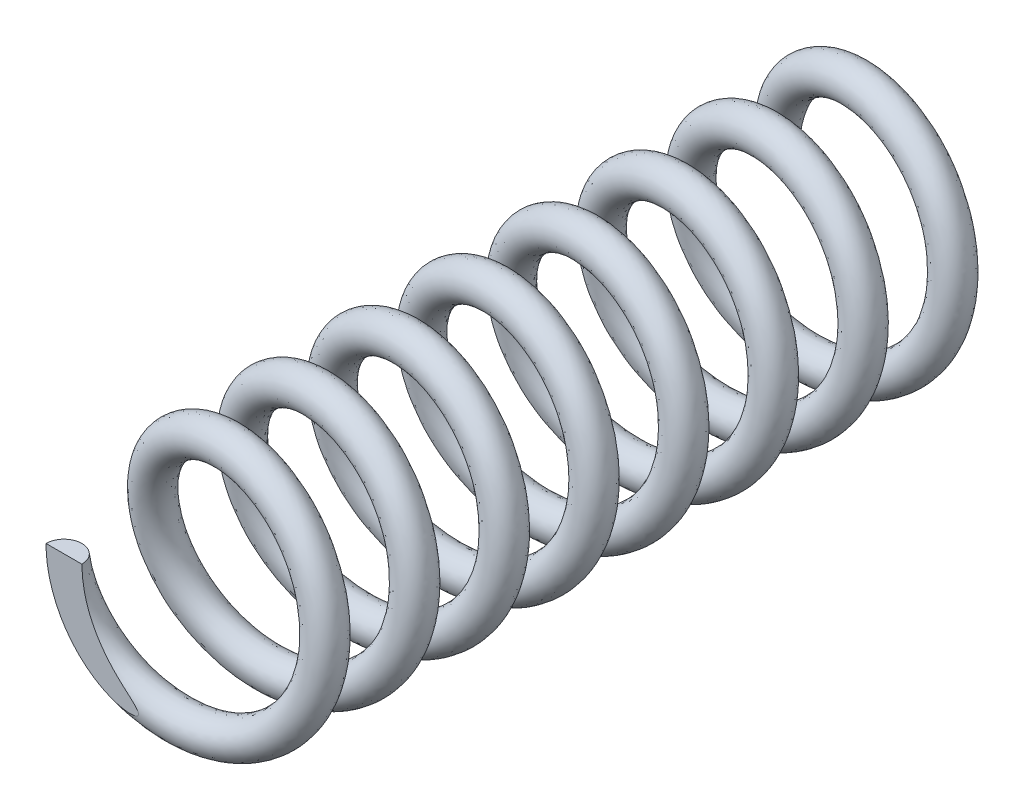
from build123d import *

# Parameters (mm, degrees)
BALAYAGE1_PITCH              = 5
BALAYAGE1_HEIGHT             = 40
BALAYAGE1_RADIUS             = 6
BALAYAGE1_START_ANGLE        = -180
ESQUISSE4_R                  = 1
ENL_V_MAT_EXTRU_1_DEPTH      = 43.17819348
ENL_V_MAT_EXTRU_1_DEPTH_BACK = 43.17819348
ESQUISSE5_W                  = 18.608227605
ESQUISSE5_H                  = 2.668204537
ESQUISSE5_W_2                = 24.602580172
ESQUISSE5_H_2                = 3.5


with BuildPart() as part:
    # Balayage1: sweep along a helix
    with BuildLine() as balayage1_path:
        add(Helix(BALAYAGE1_PITCH, BALAYAGE1_HEIGHT, BALAYAGE1_RADIUS, center=(0, 0, 0), direction=(0, 0, 1), lefthand=True, mode=Mode.PRIVATE).rotate(Axis((0, 0, 0), (0, 0, 1)), BALAYAGE1_START_ANGLE))
    # Esquisse4 → Balayage1 (sweep)
    with BuildSketch(Plane(origin=(0, 0, 0), x_dir=(1, 0, 0), z_dir=(0, 1, 0))):
        with Locations((-6, -40)):
            Circle(ESQUISSE4_R)
    sweep(path=balayage1_path.line, is_frenet=True)

    # Esquisse5 → Enl_v. mat.-Extru.1 (cut, two sides: drawn at the far end of the back side and taken through both)
    with BuildSketch(Plane(origin=(0, 0, 0), x_dir=(1, 0, 0), z_dir=(0, 1, 0)).offset(-ENL_V_MAT_EXTRU_1_DEPTH_BACK)):
        with Locations((-9.304113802, 1.334102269)):
            Rectangle(ESQUISSE5_W, ESQUISSE5_H)
        with Locations((-1.549596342, -41.75)):
            Rectangle(ESQUISSE5_W_2, ESQUISSE5_H_2)
    extrude(amount=ENL_V_MAT_EXTRU_1_DEPTH + ENL_V_MAT_EXTRU_1_DEPTH_BACK, mode=Mode.SUBTRACT)


solid = part.part
